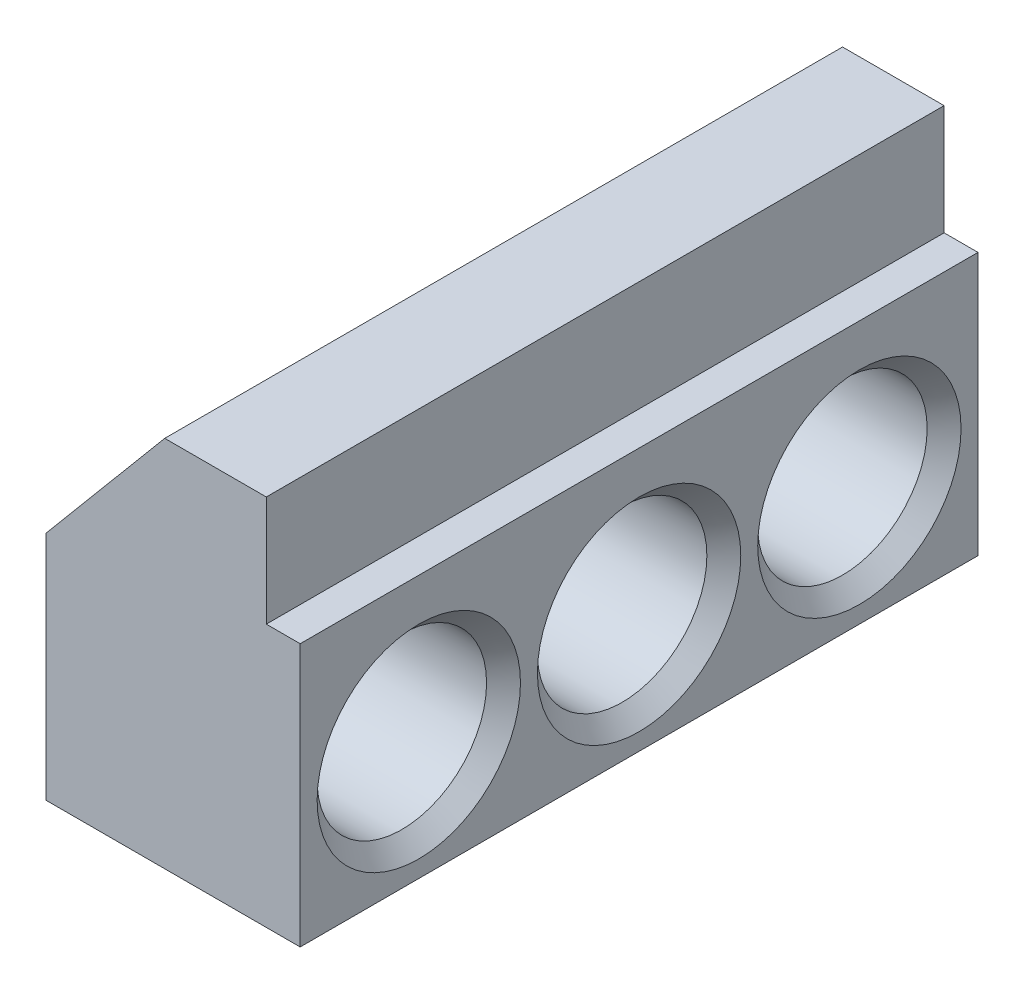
from build123d import *

# Parameters (mm, degrees)
BASE_EXTRUSION_DEPTH    = 40
ESQUISSE4_W             = 2
ESQUISSE4_H             = 6.5
ENL_V_MAT_EXTRU_1_DEPTH = 49.052055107
ESQUISSE5_R             = 5
ENL_V_MAT_EXTRU_2_DEPTH = 49.052055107
CHANFREIN1_SIZE         = 1
ESQUISSE6_R             = 5
ENL_V_MAT_EXTRU_3_DEPTH = 11
CHANFREIN2_SIZE         = 1
ESQUISSE7_R             = 3
ENL_V_MAT_EXTRU_4_DEPTH = 47.957427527
CHANFREIN3_SIZE         = 0.5


with BuildPart() as part:
    # Esquisse3 → Base-Extrusion (new body)
    with BuildSketch(Plane.XY):
        Polygon((7.006247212, 22), (0, 13.65), (0, 0), (15, 0), (15, 22), align=None)
    extrude(amount=-BASE_EXTRUSION_DEPTH)

    # Esquisse4 → Enl_v. mat.-Extru.1 (cut, through all)
    with BuildSketch(Plane.XY):
        with Locations((14, 18.75)):
            Rectangle(ESQUISSE4_W, ESQUISSE4_H)
    extrude(amount=-ENL_V_MAT_EXTRU_1_DEPTH, mode=Mode.SUBTRACT)

    # Esquisse5 → Enl_v. mat.-Extru.2 (cut, through all)
    with BuildSketch(Plane(origin=(15, 0, 0), x_dir=(0, 0, -1), z_dir=(1, 0, 0))):
        with Locations((7, 7)):
            Circle(ESQUISSE5_R)
        with Locations((33, 7)):
            Circle(ESQUISSE5_R)
    extrude(amount=-ENL_V_MAT_EXTRU_2_DEPTH, mode=Mode.SUBTRACT)

    # Chanfrein1
    chanfrein1_edges = [part.edges().sort_by_distance(p)[0] for p in [
        (0, 7, -28),
        (0, 7, -2),
        (15, 7, -28),
        (15, 7, -2),
    ]]
    chamfer(chanfrein1_edges, length=CHANFREIN1_SIZE)

    # Esquisse6 → Enl_v. mat.-Extru.3 (cut)
    with BuildSketch(Plane(origin=(15, 0, 0), x_dir=(0, 0, -1), z_dir=(1, 0, 0))):
        with Locations(Location((20, 7, 0), (0, 0, 90))):
            Circle(ESQUISSE6_R)
    extrude(amount=-ENL_V_MAT_EXTRU_3_DEPTH, mode=Mode.SUBTRACT)

    # Chanfrein2
    chanfrein2_edges = [part.edges().sort_by_distance(p)[0] for p in [
        (15, 2, -20),
    ]]
    chamfer(chanfrein2_edges, length=CHANFREIN2_SIZE)

    # Esquisse7 → Enl_v. mat.-Extru.4 (cut, through all)
    with BuildSketch(Plane(origin=(4, 0, 0), x_dir=(0, 0, -1), z_dir=(1, 0, 0))):
        with Locations(Location((20, 7, 0), (0, 0, 90))):
            Circle(ESQUISSE7_R)
    extrude(amount=-ENL_V_MAT_EXTRU_4_DEPTH, mode=Mode.SUBTRACT)

    # Chanfrein3
    chanfrein3_edges = [part.edges().sort_by_distance(p)[0] for p in [
        (0, 4, -20),
    ]]
    chamfer(chanfrein3_edges, length=CHANFREIN3_SIZE)


solid = part.part
